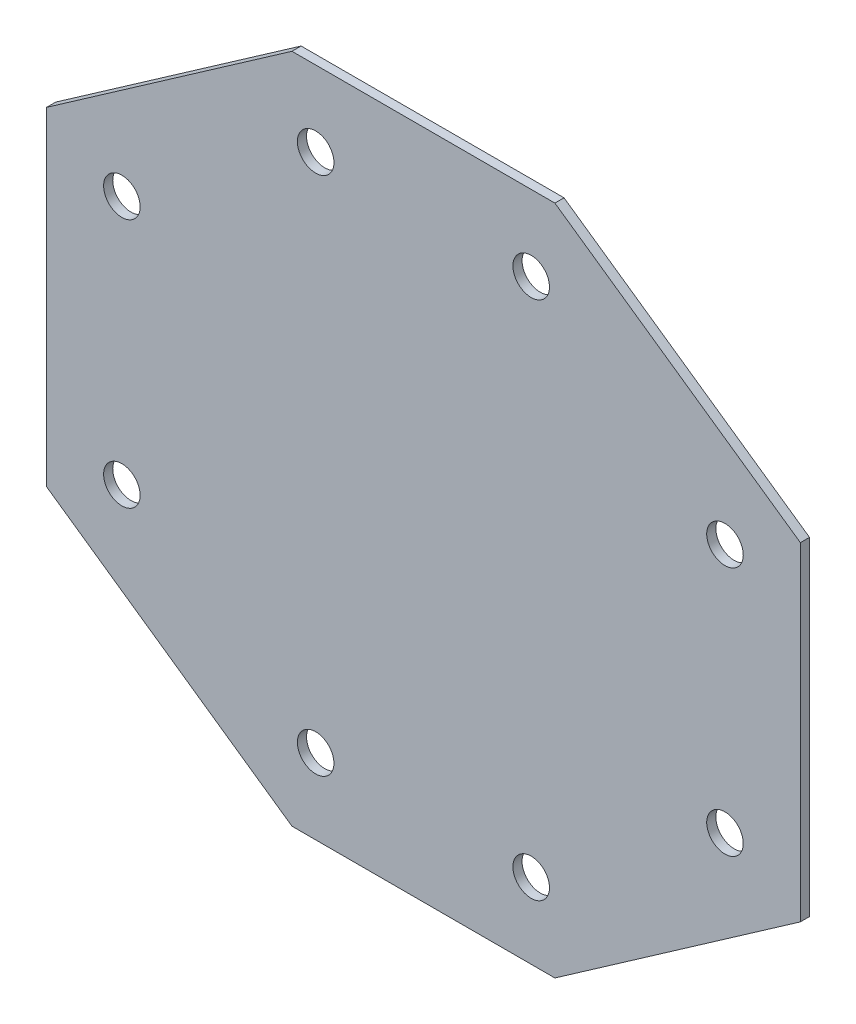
from build123d import *

# Parameters (mm, degrees)
MAIN_PLATE_DEPTH        = 12.7
CUT_EXTRUDE1_DEPTH      = 702.458448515
CUT_EXTRUDE1_DEPTH_BACK = 702.458448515
SKETCH5_R               = 25.4


with BuildPart() as part:
    # Sketch3 → Main Plate (new body)
    with BuildSketch(Plane(origin=(0, 0, 0), x_dir=(0, 1, 0), z_dir=(0, 0, 1))):
        Polygon((228.234235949, 523.855268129), (466.324268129, 182.70492307), (466.324268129, -182.70492307), (228.234235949, -523.855268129), (-228.234235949, -523.855268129), (-466.324268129, -182.70492307), (-466.324268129, 182.70492307), (-228.234235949, 523.855268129), align=None)
    extrude(amount=MAIN_PLATE_DEPTH)

    # Sketch5 → Cut-Extrude1 (cut, two sides: drawn at the far end of the back side and taken through both)
    with BuildSketch(Plane(origin=(0, 0, 0), x_dir=(0, 1, 0), z_dir=(0, 0, 1)).offset(-CUT_EXTRUDE1_DEPTH_BACK)):
        with Locations(Location((-173.588730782, 419.080268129, 0), (0, 0, 270))):
            Circle(SKETCH5_R)
        with Locations(Location((173.588730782, 419.080268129, 0), (0, 0, 270))):
            Circle(SKETCH5_R)
        with Locations(Location((361.549268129, 149.758610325, 0), (0, 0, 270))):
            Circle(SKETCH5_R)
        with Locations(Location((361.549268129, -149.758610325, 0), (0, 0, 270))):
            Circle(SKETCH5_R)
        with Locations(Location((173.588730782, -419.080268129, 0), (0, 0, 270))):
            Circle(SKETCH5_R)
        with Locations(Location((-173.588730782, -419.080268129, 0), (0, 0, 270))):
            Circle(SKETCH5_R)
        with Locations(Location((-361.549268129, -149.758610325, 0), (0, 0, 270))):
            Circle(SKETCH5_R)
        with Locations(Location((-361.549268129, 149.758610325, 0), (0, 0, 270))):
            Circle(SKETCH5_R)
    extrude(amount=CUT_EXTRUDE1_DEPTH + CUT_EXTRUDE1_DEPTH_BACK, mode=Mode.SUBTRACT)


solid = part.part
